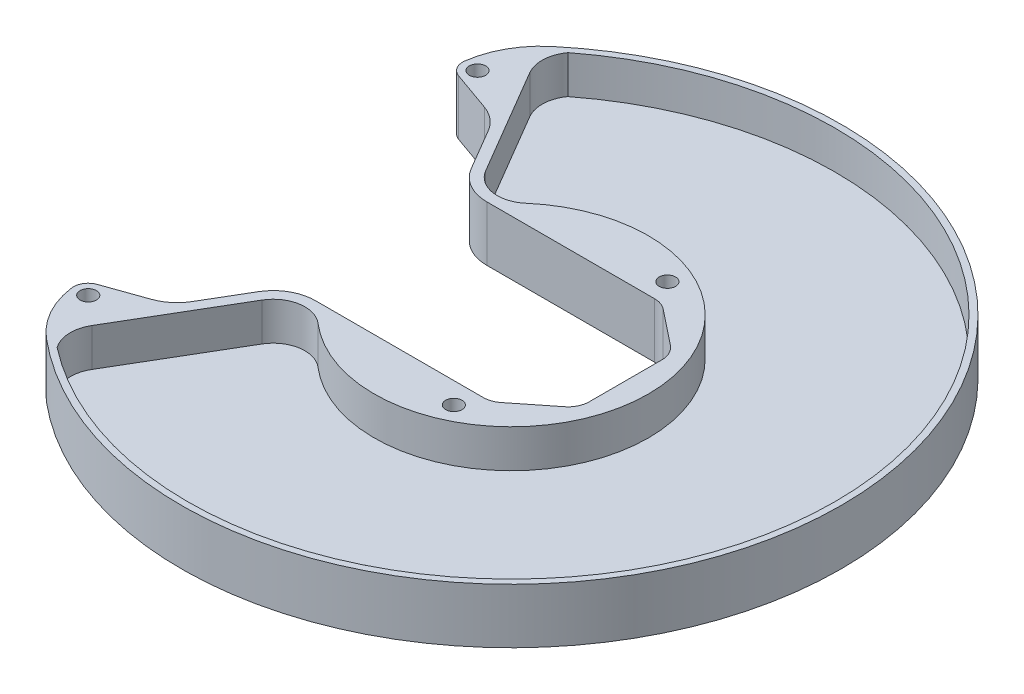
ISO-10303-21;
HEADER;
FILE_DESCRIPTION(('STEP AP214'),'2;1');
FILE_NAME('part.step','',(''),(''),'','','');
FILE_SCHEMA(('AUTOMOTIVE_DESIGN { 1 0 10303 214 1 1 1 1 }'));
ENDSEC;
DATA;
#1=APPLICATION_CONTEXT('core data for automotive mechanical design processes');
#2=APPLICATION_PROTOCOL_DEFINITION('international standard','automotive_design',2000,#1);
#3=PRODUCT_CONTEXT('',#1,'mechanical');
#4=PRODUCT('Part','Part','',(#3));
#5=PRODUCT_RELATED_PRODUCT_CATEGORY('part','',(#4));
#6=PRODUCT_DEFINITION_FORMATION('','',#4);
#7=PRODUCT_DEFINITION_CONTEXT('part definition',#1,'design');
#8=PRODUCT_DEFINITION('design','',#6,#7);
#9=PRODUCT_DEFINITION_SHAPE('','',#8);
#10=(LENGTH_UNIT() NAMED_UNIT(*) SI_UNIT(.MILLI.,.METRE.));
#11=(NAMED_UNIT(*) PLANE_ANGLE_UNIT() SI_UNIT($,.RADIAN.));
#12=(NAMED_UNIT(*) SI_UNIT($,.STERADIAN.) SOLID_ANGLE_UNIT());
#13=UNCERTAINTY_MEASURE_WITH_UNIT(LENGTH_MEASURE(1.E-05),#10,'distance_accuracy_value','');
#14=(GEOMETRIC_REPRESENTATION_CONTEXT(3) GLOBAL_UNCERTAINTY_ASSIGNED_CONTEXT((#13)) GLOBAL_UNIT_ASSIGNED_CONTEXT((#10,
#11,#12)) REPRESENTATION_CONTEXT('',''));
#15=CARTESIAN_POINT('',(0.,0.,0.));
#16=DIRECTION('',(0.,0.,1.));
#17=DIRECTION('',(1.,0.,0.));
#18=AXIS2_PLACEMENT_3D('',#15,#16,#17);
#19=CARTESIAN_POINT('',(-51.559580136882,16.51,-70.8038124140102));
#20=DIRECTION('',(0.,-1.,0.));
#21=DIRECTION('',(0.,0.,-1.));
#22=AXIS2_PLACEMENT_3D('',#19,#20,#21);
#23=CYLINDRICAL_SURFACE('',#22,10.0119999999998);
#24=DIRECTION('',(0.,-1.,0.));
#25=VECTOR('',#24,1.);
#26=CARTESIAN_POINT('',(-60.190030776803,16.51,-65.728828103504));
#27=LINE('',#26,#25);
#28=CARTESIAN_POINT('',(-60.190030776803,16.51,-65.728828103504));
#29=VERTEX_POINT('',#28);
#30=CARTESIAN_POINT('',(-60.190030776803,5.08,-65.728828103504));
#31=VERTEX_POINT('',#30);
#32=EDGE_CURVE('E343',#29,#31,#27,.T.);
#33=ORIENTED_EDGE('',*,*,#32,.T.);
#34=CARTESIAN_POINT('',(-51.559580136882,5.08,-70.8038124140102));
#35=DIRECTION('',(0.,-1.,0.));
#36=DIRECTION('',(0.,0.,-1.));
#37=AXIS2_PLACEMENT_3D('',#34,#35,#36);
#38=CIRCLE('',#37,10.0119999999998);
#39=CARTESIAN_POINT('',(-59.6737233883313,5.08,-76.6690339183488));
#40=VERTEX_POINT('',#39);
#41=EDGE_CURVE('E525',#31,#40,#38,.T.);
#42=ORIENTED_EDGE('',*,*,#41,.T.);
#43=DIRECTION('',(0.,-1.,0.));
#44=VECTOR('',#43,1.);
#45=CARTESIAN_POINT('',(-59.6737233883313,16.51,-76.6690339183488));
#46=LINE('',#45,#44);
#47=CARTESIAN_POINT('',(-59.6737233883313,16.51,-76.6690339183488));
#48=VERTEX_POINT('',#47);
#49=EDGE_CURVE('E499',#48,#40,#46,.T.);
#50=ORIENTED_EDGE('',*,*,#49,.F.);
#51=CARTESIAN_POINT('',(-51.559580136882,16.51,-70.8038124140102));
#52=DIRECTION('',(0.,1.,0.));
#53=DIRECTION('',(0.,0.,1.));
#54=AXIS2_PLACEMENT_3D('',#51,#52,#53);
#55=CIRCLE('',#54,10.0119999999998);
#56=EDGE_CURVE('E522',#48,#29,#55,.T.);
#57=ORIENTED_EDGE('',*,*,#56,.T.);
#58=EDGE_LOOP('',(#33,#42,#50,#57));
#59=FACE_BOUND('',#58,.T.);
#60=ADVANCED_FACE('F41',(#59),#23,.F.);
#61=CARTESIAN_POINT('',(-60.190030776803,16.51,-65.728828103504));
#62=DIRECTION('',(0.862010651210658,0.,-0.506890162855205));
#63=DIRECTION('',(-0.506890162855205,0.,-0.862010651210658));
#64=AXIS2_PLACEMENT_3D('',#61,#62,#63);
#65=PLANE('',#64);
#66=DIRECTION('',(0.,-1.,0.));
#67=VECTOR('',#66,1.);
#68=CARTESIAN_POINT('',(-41.2820936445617,16.51,-33.5742423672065));
#69=LINE('',#68,#67);
#70=CARTESIAN_POINT('',(-41.2820936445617,16.51,-33.5742423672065));
#71=VERTEX_POINT('',#70);
#72=CARTESIAN_POINT('',(-41.2820936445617,5.08,-33.5742423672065));
#73=VERTEX_POINT('',#72);
#74=EDGE_CURVE('E477',#71,#73,#69,.T.);
#75=ORIENTED_EDGE('',*,*,#74,.T.);
#76=DIRECTION('',(-0.506890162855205,0.,-0.862010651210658));
#77=VECTOR('',#76,1.);
#78=CARTESIAN_POINT('',(-60.190030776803,5.08,-65.728828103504));
#79=LINE('',#78,#77);
#80=EDGE_CURVE('E529',#73,#31,#79,.T.);
#81=ORIENTED_EDGE('',*,*,#80,.T.);
#82=ORIENTED_EDGE('',*,*,#32,.F.);
#83=DIRECTION('',(0.506890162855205,0.,0.862010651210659));
#84=VECTOR('',#83,1.);
#85=CARTESIAN_POINT('',(-60.190030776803,16.51,-65.728828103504));
#86=LINE('',#85,#84);
#87=EDGE_CURVE('E519',#29,#71,#86,.T.);
#88=ORIENTED_EDGE('',*,*,#87,.T.);
#89=EDGE_LOOP('',(#75,#81,#82,#88));
#90=FACE_BOUND('',#89,.T.);
#91=ADVANCED_FACE('F680',(#90),#65,.T.);
#92=CARTESIAN_POINT('',(-33.0714421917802,16.51,-38.4023711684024));
#93=DIRECTION('',(0.,-1.,0.));
#94=DIRECTION('',(0.,0.,-1.));
#95=AXIS2_PLACEMENT_3D('',#92,#93,#94);
#96=CYLINDRICAL_SURFACE('',#95,9.52500000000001);
#97=DIRECTION('',(0.,-1.,0.));
#98=VECTOR('',#97,1.);
#99=CARTESIAN_POINT('',(-26.8558643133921,16.51,-31.184877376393));
#100=LINE('',#99,#98);
#101=CARTESIAN_POINT('',(-26.8558643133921,16.51,-31.184877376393));
#102=VERTEX_POINT('',#101);
#103=CARTESIAN_POINT('',(-26.8558643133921,5.08,-31.184877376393));
#104=VERTEX_POINT('',#103);
#105=EDGE_CURVE('E481',#102,#104,#100,.T.);
#106=ORIENTED_EDGE('',*,*,#105,.T.);
#107=CARTESIAN_POINT('',(-33.0714421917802,5.08,-38.4023711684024));
#108=DIRECTION('',(0.,-1.,0.));
#109=DIRECTION('',(0.,0.,-1.));
#110=AXIS2_PLACEMENT_3D('',#107,#108,#109);
#111=CIRCLE('',#110,9.52500000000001);
#112=EDGE_CURVE('E533',#104,#73,#111,.T.);
#113=ORIENTED_EDGE('',*,*,#112,.T.);
#114=ORIENTED_EDGE('',*,*,#74,.F.);
#115=CARTESIAN_POINT('',(-33.0714421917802,16.51,-38.4023711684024));
#116=DIRECTION('',(0.,1.,0.));
#117=DIRECTION('',(0.,0.,-1.));
#118=AXIS2_PLACEMENT_3D('',#115,#116,#117);
#119=CIRCLE('',#118,9.52500000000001);
#120=EDGE_CURVE('E516',#71,#102,#119,.T.);
#121=ORIENTED_EDGE('',*,*,#120,.T.);
#122=EDGE_LOOP('',(#106,#113,#114,#121));
#123=FACE_BOUND('',#122,.T.);
#124=ADVANCED_FACE('F686',(#123),#96,.F.);
#125=CARTESIAN_POINT('',(0.,16.51,0.));
#126=DIRECTION('',(0.,-1.,0.));
#127=DIRECTION('',(0.,0.,-1.));
#128=AXIS2_PLACEMENT_3D('',#125,#126,#127);
#129=CYLINDRICAL_SURFACE('',#128,41.155);
#130=DIRECTION('',(0.,-1.,0.));
#131=VECTOR('',#130,1.);
#132=CARTESIAN_POINT('',(-26.8558643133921,16.51,31.184877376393));
#133=LINE('',#132,#131);
#134=CARTESIAN_POINT('',(-26.8558643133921,16.51,31.184877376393));
#135=VERTEX_POINT('',#134);
#136=CARTESIAN_POINT('',(-26.8558643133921,5.08,31.184877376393));
#137=VERTEX_POINT('',#136);
#138=EDGE_CURVE('E485',#135,#137,#133,.T.);
#139=ORIENTED_EDGE('',*,*,#138,.T.);
#140=CARTESIAN_POINT('',(0.,5.08,0.));
#141=DIRECTION('',(0.,-1.,0.));
#142=DIRECTION('',(0.,0.,-1.));
#143=AXIS2_PLACEMENT_3D('',#140,#141,#142);
#144=CIRCLE('',#143,41.155);
#145=EDGE_CURVE('E537',#137,#104,#144,.F.);
#146=ORIENTED_EDGE('',*,*,#145,.T.);
#147=ORIENTED_EDGE('',*,*,#105,.F.);
#148=CARTESIAN_POINT('',(0.,16.51,0.));
#149=DIRECTION('',(0.,-1.,0.));
#150=DIRECTION('',(0.,0.,-1.));
#151=AXIS2_PLACEMENT_3D('',#148,#149,#150);
#152=CIRCLE('',#151,41.155);
#153=EDGE_CURVE('E514',#102,#135,#152,.T.);
#154=ORIENTED_EDGE('',*,*,#153,.T.);
#155=EDGE_LOOP('',(#139,#146,#147,#154));
#156=FACE_BOUND('',#155,.T.);
#157=ADVANCED_FACE('F774',(#156),#129,.T.);
#158=CARTESIAN_POINT('',(-33.0714421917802,16.51,38.4023711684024));
#159=DIRECTION('',(0.,-1.,0.));
#160=DIRECTION('',(0.,0.,-1.));
#161=AXIS2_PLACEMENT_3D('',#158,#159,#160);
#162=CYLINDRICAL_SURFACE('',#161,9.52500000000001);
#163=DIRECTION('',(0.,-1.,0.));
#164=VECTOR('',#163,1.);
#165=CARTESIAN_POINT('',(-41.2820936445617,16.51,33.5742423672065));
#166=LINE('',#165,#164);
#167=CARTESIAN_POINT('',(-41.2820936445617,16.51,33.5742423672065));
#168=VERTEX_POINT('',#167);
#169=CARTESIAN_POINT('',(-41.2820936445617,5.08,33.5742423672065));
#170=VERTEX_POINT('',#169);
#171=EDGE_CURVE('E489',#168,#170,#166,.T.);
#172=ORIENTED_EDGE('',*,*,#171,.T.);
#173=CARTESIAN_POINT('',(-33.0714421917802,5.08,38.4023711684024));
#174=DIRECTION('',(0.,-1.,0.));
#175=DIRECTION('',(0.,0.,-1.));
#176=AXIS2_PLACEMENT_3D('',#173,#174,#175);
#177=CIRCLE('',#176,9.52500000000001);
#178=EDGE_CURVE('E541',#170,#137,#177,.T.);
#179=ORIENTED_EDGE('',*,*,#178,.T.);
#180=ORIENTED_EDGE('',*,*,#138,.F.);
#181=CARTESIAN_POINT('',(-33.0714421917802,16.51,38.4023711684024));
#182=DIRECTION('',(0.,1.,0.));
#183=DIRECTION('',(0.,0.,-1.));
#184=AXIS2_PLACEMENT_3D('',#181,#182,#183);
#185=CIRCLE('',#184,9.52500000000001);
#186=EDGE_CURVE('E512',#135,#168,#185,.T.);
#187=ORIENTED_EDGE('',*,*,#186,.T.);
#188=EDGE_LOOP('',(#172,#179,#180,#187));
#189=FACE_BOUND('',#188,.T.);
#190=ADVANCED_FACE('F770',(#189),#162,.F.);
#191=CARTESIAN_POINT('',(-60.190030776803,16.51,65.728828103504));
#192=DIRECTION('',(0.862010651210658,0.,0.506890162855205));
#193=DIRECTION('',(0.506890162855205,0.,-0.862010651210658));
#194=AXIS2_PLACEMENT_3D('',#191,#192,#193);
#195=PLANE('',#194);
#196=DIRECTION('',(0.,-1.,0.));
#197=VECTOR('',#196,1.);
#198=CARTESIAN_POINT('',(-60.190030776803,16.51,65.728828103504));
#199=LINE('',#198,#197);
#200=CARTESIAN_POINT('',(-60.190030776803,16.51,65.728828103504));
#201=VERTEX_POINT('',#200);
#202=CARTESIAN_POINT('',(-60.190030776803,5.08,65.728828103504));
#203=VERTEX_POINT('',#202);
#204=EDGE_CURVE('E493',#201,#203,#199,.T.);
#205=ORIENTED_EDGE('',*,*,#204,.T.);
#206=DIRECTION('',(0.506890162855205,0.,-0.862010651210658));
#207=VECTOR('',#206,1.);
#208=CARTESIAN_POINT('',(-60.190030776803,5.08,65.728828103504));
#209=LINE('',#208,#207);
#210=EDGE_CURVE('E544',#203,#170,#209,.T.);
#211=ORIENTED_EDGE('',*,*,#210,.T.);
#212=ORIENTED_EDGE('',*,*,#171,.F.);
#213=DIRECTION('',(-0.506890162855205,0.,0.862010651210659));
#214=VECTOR('',#213,1.);
#215=CARTESIAN_POINT('',(-60.190030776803,16.51,65.728828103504));
#216=LINE('',#215,#214);
#217=EDGE_CURVE('E509',#168,#201,#216,.T.);
#218=ORIENTED_EDGE('',*,*,#217,.T.);
#219=EDGE_LOOP('',(#205,#211,#212,#218));
#220=FACE_BOUND('',#219,.T.);
#221=ADVANCED_FACE('F766',(#220),#195,.T.);
#222=CARTESIAN_POINT('',(-51.559580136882,16.51,70.8038124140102));
#223=DIRECTION('',(0.,-1.,0.));
#224=DIRECTION('',(0.,0.,-1.));
#225=AXIS2_PLACEMENT_3D('',#222,#223,#224);
#226=CYLINDRICAL_SURFACE('',#225,10.0119999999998);
#227=DIRECTION('',(0.,-1.,0.));
#228=VECTOR('',#227,1.);
#229=CARTESIAN_POINT('',(-59.6737233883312,16.51,76.6690339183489));
#230=LINE('',#229,#228);
#231=CARTESIAN_POINT('',(-59.6737233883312,16.51,76.6690339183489));
#232=VERTEX_POINT('',#231);
#233=CARTESIAN_POINT('',(-59.6737233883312,5.08,76.6690339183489));
#234=VERTEX_POINT('',#233);
#235=EDGE_CURVE('E496',#232,#234,#230,.T.);
#236=ORIENTED_EDGE('',*,*,#235,.T.);
#237=CARTESIAN_POINT('',(-51.559580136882,5.08,70.8038124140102));
#238=DIRECTION('',(0.,-1.,0.));
#239=DIRECTION('',(0.,0.,-1.));
#240=AXIS2_PLACEMENT_3D('',#237,#238,#239);
#241=CIRCLE('',#240,10.0119999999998);
#242=EDGE_CURVE('E548',#234,#203,#241,.T.);
#243=ORIENTED_EDGE('',*,*,#242,.T.);
#244=ORIENTED_EDGE('',*,*,#204,.F.);
#245=CARTESIAN_POINT('',(-51.559580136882,16.51,70.8038124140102));
#246=DIRECTION('',(0.,1.,0.));
#247=DIRECTION('',(0.,0.,-1.));
#248=AXIS2_PLACEMENT_3D('',#245,#246,#247);
#249=CIRCLE('',#248,10.0119999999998);
#250=EDGE_CURVE('E506',#201,#232,#249,.T.);
#251=ORIENTED_EDGE('',*,*,#250,.T.);
#252=EDGE_LOOP('',(#236,#243,#244,#251));
#253=FACE_BOUND('',#252,.T.);
#254=ADVANCED_FACE('F762',(#253),#226,.F.);
#255=CARTESIAN_POINT('',(0.,16.51,0.));
#256=DIRECTION('',(0.,-1.,0.));
#257=DIRECTION('',(0.,0.,-1.));
#258=AXIS2_PLACEMENT_3D('',#255,#256,#257);
#259=CYLINDRICAL_SURFACE('',#258,97.155);
#260=ORIENTED_EDGE('',*,*,#49,.T.);
#261=CARTESIAN_POINT('',(0.,5.08,0.));
#262=DIRECTION('',(0.,-1.,0.));
#263=DIRECTION('',(0.,0.,-1.));
#264=AXIS2_PLACEMENT_3D('',#261,#262,#263);
#265=CIRCLE('',#264,97.155);
#266=EDGE_CURVE('E385',#40,#234,#265,.T.);
#267=ORIENTED_EDGE('',*,*,#266,.T.);
#268=ORIENTED_EDGE('',*,*,#235,.F.);
#269=CARTESIAN_POINT('',(0.,16.51,0.));
#270=DIRECTION('',(0.,1.,0.));
#271=DIRECTION('',(0.,0.,-1.));
#272=AXIS2_PLACEMENT_3D('',#269,#270,#271);
#273=CIRCLE('',#272,97.155);
#274=EDGE_CURVE('E503',#232,#48,#273,.T.);
#275=ORIENTED_EDGE('',*,*,#274,.T.);
#276=EDGE_LOOP('',(#260,#267,#268,#275));
#277=FACE_BOUND('',#276,.T.);
#278=ADVANCED_FACE('F654',(#277),#259,.F.);
#279=CARTESIAN_POINT('',(-33.0714421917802,16.51,-38.4023711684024));
#280=DIRECTION('',(0.,1.,0.));
#281=DIRECTION('',(0.,0.,1.));
#282=AXIS2_PLACEMENT_3D('',#279,#280,#281);
#283=PLANE('',#282);
#284=CARTESIAN_POINT('',(-68.58,16.51,-58.42));
#285=DIRECTION('',(0.,1.,0.));
#286=DIRECTION('',(0.,0.,1.));
#287=AXIS2_PLACEMENT_3D('',#284,#285,#286);
#288=CIRCLE('',#287,2.45745);
#289=CARTESIAN_POINT('',(-68.58,16.51,-55.96255));
#290=VERTEX_POINT('',#289);
#291=EDGE_CURVE('E645',#290,#290,#288,.T.);
#292=ORIENTED_EDGE('',*,*,#291,.F.);
#293=EDGE_LOOP('',(#292));
#294=FACE_BOUND('',#293,.T.);
#295=CARTESIAN_POINT('',(-68.58,16.51,58.42));
#296=DIRECTION('',(0.,1.,0.));
#297=DIRECTION('',(0.,0.,1.));
#298=AXIS2_PLACEMENT_3D('',#295,#296,#297);
#299=CIRCLE('',#298,2.45745);
#300=CARTESIAN_POINT('',(-68.58,16.51,60.87745));
#301=VERTEX_POINT('',#300);
#302=EDGE_CURVE('E637',#301,#301,#299,.T.);
#303=ORIENTED_EDGE('',*,*,#302,.F.);
#304=EDGE_LOOP('',(#303));
#305=FACE_BOUND('',#304,.T.);
#306=CARTESIAN_POINT('',(14.7983753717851,16.51,32.0523711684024));
#307=DIRECTION('',(0.,1.,0.));
#308=DIRECTION('',(0.,0.,1.));
#309=AXIS2_PLACEMENT_3D('',#306,#307,#308);
#310=CIRCLE('',#309,2.45745);
#311=CARTESIAN_POINT('',(14.7983753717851,16.51,34.5098211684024));
#312=VERTEX_POINT('',#311);
#313=EDGE_CURVE('E630',#312,#312,#310,.T.);
#314=ORIENTED_EDGE('',*,*,#313,.F.);
#315=EDGE_LOOP('',(#314));
#316=FACE_BOUND('',#315,.T.);
#317=CARTESIAN_POINT('',(14.7983753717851,16.51,-32.0523711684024));
#318=DIRECTION('',(0.,1.,0.));
#319=DIRECTION('',(0.,0.,1.));
#320=AXIS2_PLACEMENT_3D('',#317,#318,#319);
#321=CIRCLE('',#320,2.45745);
#322=CARTESIAN_POINT('',(14.7983753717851,16.51,-29.5949211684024));
#323=VERTEX_POINT('',#322);
#324=EDGE_CURVE('E623',#323,#323,#321,.T.);
#325=ORIENTED_EDGE('',*,*,#324,.F.);
#326=EDGE_LOOP('',(#325));
#327=FACE_BOUND('',#326,.T.);
#328=CARTESIAN_POINT('',(-62.3081755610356,16.51,-38.0124949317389));
#329=DIRECTION('',(0.,-1.,0.));
#330=DIRECTION('',(0.,0.,-1.));
#331=AXIS2_PLACEMENT_3D('',#328,#329,#330);
#332=CIRCLE('',#331,12.7);
#333=CARTESIAN_POINT('',(-58.0703499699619,16.51,-49.9845805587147));
#334=VERTEX_POINT('',#333);
#335=CARTESIAN_POINT('',(-51.3606402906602,16.51,-44.45));
#336=VERTEX_POINT('',#335);
#337=EDGE_CURVE('E560',#334,#336,#332,.T.);
#338=ORIENTED_EDGE('',*,*,#337,.T.);
#339=DIRECTION('',(0.506890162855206,0.,0.862010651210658));
#340=VECTOR('',#339,1.);
#341=CARTESIAN_POINT('',(-67.730120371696,16.51,-72.2877195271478));
#342=LINE('',#341,#340);
#343=CARTESIAN_POINT('',(-44.0189774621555,16.51,-31.9648661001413));
#344=VERTEX_POINT('',#343);
#345=EDGE_CURVE('E315',#336,#344,#342,.T.);
#346=ORIENTED_EDGE('',*,*,#345,.T.);
#347=CARTESIAN_POINT('',(-33.0714421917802,16.51,-38.4023711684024));
#348=DIRECTION('',(0.,1.,0.));
#349=DIRECTION('',(0.,0.,1.));
#350=AXIS2_PLACEMENT_3D('',#347,#348,#349);
#351=CIRCLE('',#350,12.7);
#352=CARTESIAN_POINT('',(-33.0714421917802,16.51,-25.7023711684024));
#353=VERTEX_POINT('',#352);
#354=EDGE_CURVE('E324',#344,#353,#351,.T.);
#355=ORIENTED_EDGE('',*,*,#354,.T.);
#356=DIRECTION('',(1.,0.,0.));
#357=VECTOR('',#356,1.);
#358=CARTESIAN_POINT('',(19.5169095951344,16.51,-25.7023711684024));
#359=LINE('',#358,#357);
#360=CARTESIAN_POINT('',(17.302149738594,16.51,-25.7023711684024));
#361=VERTEX_POINT('',#360);
#362=EDGE_CURVE('E327',#353,#361,#359,.T.);
#363=ORIENTED_EDGE('',*,*,#362,.T.);
#364=CARTESIAN_POINT('',(17.302149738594,16.51,-19.3523711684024));
#365=DIRECTION('',(0.,1.,0.));
#366=DIRECTION('',(0.,0.,1.));
#367=AXIS2_PLACEMENT_3D('',#364,#365,#366);
#368=CIRCLE('',#367,6.35);
#369=CARTESIAN_POINT('',(21.2512663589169,16.51,-24.324994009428));
#370=VERTEX_POINT('',#369);
#371=EDGE_CURVE('E428',#361,#370,#368,.F.);
#372=ORIENTED_EDGE('',*,*,#371,.T.);
#373=DIRECTION('',(0.783090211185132,0.,0.62190812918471));
#374=VECTOR('',#373,1.);
#375=CARTESIAN_POINT('',(19.5169095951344,16.51,-25.7023711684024));
#376=LINE('',#375,#374);
#377=CARTESIAN_POINT('',(31.8891166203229,16.51,-15.8767137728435));
#378=VERTEX_POINT('',#377);
#379=EDGE_CURVE('E331',#370,#378,#376,.T.);
#380=ORIENTED_EDGE('',*,*,#379,.T.);
#381=CARTESIAN_POINT('',(27.94,16.51,-10.904090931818));
#382=DIRECTION('',(0.,1.,0.));
#383=DIRECTION('',(0.,0.,1.));
#384=AXIS2_PLACEMENT_3D('',#381,#382,#383);
#385=CIRCLE('',#384,6.35);
#386=CARTESIAN_POINT('',(34.29,16.51,-10.904090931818));
#387=VERTEX_POINT('',#386);
#388=EDGE_CURVE('E11',#378,#387,#385,.F.);
#389=ORIENTED_EDGE('',*,*,#388,.T.);
#390=DIRECTION('',(0.,0.,1.));
#391=VECTOR('',#390,1.);
#392=CARTESIAN_POINT('',(34.29,16.51,13.97));
#393=LINE('',#392,#391);
#394=CARTESIAN_POINT('',(34.29,16.51,10.904090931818));
#395=VERTEX_POINT('',#394);
#396=EDGE_CURVE('E334',#387,#395,#393,.T.);
#397=ORIENTED_EDGE('',*,*,#396,.T.);
#398=CARTESIAN_POINT('',(27.94,16.51,10.904090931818));
#399=DIRECTION('',(0.,1.,0.));
#400=DIRECTION('',(0.,0.,1.));
#401=AXIS2_PLACEMENT_3D('',#398,#399,#400);
#402=CIRCLE('',#401,6.35);
#403=CARTESIAN_POINT('',(31.8891166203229,16.51,15.8767137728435));
#404=VERTEX_POINT('',#403);
#405=EDGE_CURVE('E434',#395,#404,#402,.F.);
#406=ORIENTED_EDGE('',*,*,#405,.T.);
#407=DIRECTION('',(-0.783090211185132,0.,0.62190812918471));
#408=VECTOR('',#407,1.);
#409=CARTESIAN_POINT('',(19.5169095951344,16.51,25.7023711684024));
#410=LINE('',#409,#408);
#411=CARTESIAN_POINT('',(21.2512663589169,16.51,24.324994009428));
#412=VERTEX_POINT('',#411);
#413=EDGE_CURVE('E372',#404,#412,#410,.T.);
#414=ORIENTED_EDGE('',*,*,#413,.T.);
#415=CARTESIAN_POINT('',(17.302149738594,16.51,19.3523711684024));
#416=DIRECTION('',(0.,1.,0.));
#417=DIRECTION('',(0.,0.,1.));
#418=AXIS2_PLACEMENT_3D('',#415,#416,#417);
#419=CIRCLE('',#418,6.35);
#420=CARTESIAN_POINT('',(17.302149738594,16.51,25.7023711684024));
#421=VERTEX_POINT('',#420);
#422=EDGE_CURVE('E423',#412,#421,#419,.F.);
#423=ORIENTED_EDGE('',*,*,#422,.T.);
#424=DIRECTION('',(-1.,0.,0.));
#425=VECTOR('',#424,1.);
#426=CARTESIAN_POINT('',(19.5169095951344,16.51,25.7023711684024));
#427=LINE('',#426,#425);
#428=CARTESIAN_POINT('',(-33.0714421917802,16.51,25.7023711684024));
#429=VERTEX_POINT('',#428);
#430=EDGE_CURVE('E318',#421,#429,#427,.T.);
#431=ORIENTED_EDGE('',*,*,#430,.T.);
#432=CARTESIAN_POINT('',(-33.0714421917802,16.51,38.4023711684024));
#433=DIRECTION('',(0.,1.,0.));
#434=DIRECTION('',(0.,0.,-1.));
#435=AXIS2_PLACEMENT_3D('',#432,#433,#434);
#436=CIRCLE('',#435,12.7);
#437=CARTESIAN_POINT('',(-44.0189774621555,16.51,31.9648661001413));
#438=VERTEX_POINT('',#437);
#439=EDGE_CURVE('E306',#429,#438,#436,.T.);
#440=ORIENTED_EDGE('',*,*,#439,.T.);
#441=DIRECTION('',(-0.506890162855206,0.,0.862010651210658));
#442=VECTOR('',#441,1.);
#443=CARTESIAN_POINT('',(-67.730120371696,16.51,72.2877195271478));
#444=LINE('',#443,#442);
#445=CARTESIAN_POINT('',(-51.3606402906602,16.51,44.45));
#446=VERTEX_POINT('',#445);
#447=EDGE_CURVE('E297',#438,#446,#444,.T.);
#448=ORIENTED_EDGE('',*,*,#447,.T.);
#449=CARTESIAN_POINT('',(-62.3081755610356,16.51,38.0124949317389));
#450=DIRECTION('',(0.,1.,0.));
#451=DIRECTION('',(0.,0.,1.));
#452=AXIS2_PLACEMENT_3D('',#449,#450,#451);
#453=CIRCLE('',#452,12.7);
#454=CARTESIAN_POINT('',(-58.0703499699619,16.51,49.9845805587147));
#455=VERTEX_POINT('',#454);
#456=EDGE_CURVE('E279',#455,#446,#453,.T.);
#457=ORIENTED_EDGE('',*,*,#456,.F.);
#458=DIRECTION('',(0.94268390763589,0.,-0.333687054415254));
#459=VECTOR('',#458,1.);
#460=CARTESIAN_POINT('',(-70.0632389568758,16.51,54.2297700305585));
#461=LINE('',#460,#459);
#462=CARTESIAN_POINT('',(-70.0632389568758,16.51,54.2297700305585));
#463=VERTEX_POINT('',#462);
#464=EDGE_CURVE('E291',#463,#455,#461,.T.);
#465=ORIENTED_EDGE('',*,*,#464,.F.);
#466=CARTESIAN_POINT('',(-68.58,16.51,58.42));
#467=DIRECTION('',(0.,-1.,0.));
#468=DIRECTION('',(0.,0.,-1.));
#469=AXIS2_PLACEMENT_3D('',#466,#467,#468);
#470=CIRCLE('',#469,4.445);
#471=CARTESIAN_POINT('',(-72.9842416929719,16.51,59.0205664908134));
#472=VERTEX_POINT('',#471);
#473=EDGE_CURVE('E602',#472,#463,#470,.T.);
#474=ORIENTED_EDGE('',*,*,#473,.F.);
#475=CARTESIAN_POINT('',(-46.5184478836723,16.51,55.4116662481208));
#476=DIRECTION('',(0.,-1.,0.));
#477=DIRECTION('',(0.,0.,1.));
#478=AXIS2_PLACEMENT_3D('',#475,#476,#477);
#479=CIRCLE('',#478,26.7107170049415);
#480=CARTESIAN_POINT('',(-63.6926484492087,16.51,75.8691645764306));
#481=VERTEX_POINT('',#480);
#482=EDGE_CURVE('E300',#481,#472,#479,.T.);
#483=ORIENTED_EDGE('',*,*,#482,.F.);
#484=CARTESIAN_POINT('',(0.,16.51,0.));
#485=DIRECTION('',(0.,1.,0.));
#486=DIRECTION('',(0.,0.,1.));
#487=AXIS2_PLACEMENT_3D('',#484,#485,#486);
#488=CIRCLE('',#487,99.06);
#489=CARTESIAN_POINT('',(-63.6926484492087,16.51,-75.8691645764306));
#490=VERTEX_POINT('',#489);
#491=EDGE_CURVE('E309',#481,#490,#488,.T.);
#492=ORIENTED_EDGE('',*,*,#491,.T.);
#493=CARTESIAN_POINT('',(-46.5184478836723,16.51,-55.4116662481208));
#494=DIRECTION('',(0.,1.,0.));
#495=DIRECTION('',(0.,0.,-1.));
#496=AXIS2_PLACEMENT_3D('',#493,#494,#495);
#497=CIRCLE('',#496,26.7107170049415);
#498=CARTESIAN_POINT('',(-72.9842416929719,16.51,-59.0205664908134));
#499=VERTEX_POINT('',#498);
#500=EDGE_CURVE('E579',#490,#499,#497,.T.);
#501=ORIENTED_EDGE('',*,*,#500,.T.);
#502=CARTESIAN_POINT('',(-68.58,16.51,-58.42));
#503=DIRECTION('',(0.,1.,0.));
#504=DIRECTION('',(0.,0.,1.));
#505=AXIS2_PLACEMENT_3D('',#502,#503,#504);
#506=CIRCLE('',#505,4.445);
#507=CARTESIAN_POINT('',(-70.0632389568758,16.51,-54.2297700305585));
#508=VERTEX_POINT('',#507);
#509=EDGE_CURVE('E575',#499,#508,#506,.T.);
#510=ORIENTED_EDGE('',*,*,#509,.T.);
#511=DIRECTION('',(0.94268390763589,0.,0.333687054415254));
#512=VECTOR('',#511,1.);
#513=CARTESIAN_POINT('',(-70.0632389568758,16.51,-54.2297700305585));
#514=LINE('',#513,#512);
#515=EDGE_CURVE('E571',#508,#334,#514,.T.);
#516=ORIENTED_EDGE('',*,*,#515,.T.);
#517=EDGE_LOOP('',(#338,#346,#355,#363,#372,#380,#389,#397,#406,#414,#423,#431,#440,#448,#457,
#465,#474,#483,#492,#501,#510,#516));
#518=FACE_BOUND('',#517,.T.);
#519=ORIENTED_EDGE('',*,*,#87,.F.);
#520=ORIENTED_EDGE('',*,*,#56,.F.);
#521=ORIENTED_EDGE('',*,*,#274,.F.);
#522=ORIENTED_EDGE('',*,*,#250,.F.);
#523=ORIENTED_EDGE('',*,*,#217,.F.);
#524=ORIENTED_EDGE('',*,*,#186,.F.);
#525=ORIENTED_EDGE('',*,*,#153,.F.);
#526=ORIENTED_EDGE('',*,*,#120,.F.);
#527=EDGE_LOOP('',(#519,#520,#521,#522,#523,#524,#525,#526));
#528=FACE_BOUND('',#527,.T.);
#529=ADVANCED_FACE('F303',(#294,#305,#316,#327,#518,#528),#283,.T.);
#530=CARTESIAN_POINT('',(-33.0714421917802,0.,-38.4023711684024));
#531=DIRECTION('',(0.,1.,0.));
#532=DIRECTION('',(0.,0.,1.));
#533=AXIS2_PLACEMENT_3D('',#530,#531,#532);
#534=PLANE('',#533);
#535=CARTESIAN_POINT('',(-68.58,0.,-58.42));
#536=DIRECTION('',(0.,1.,0.));
#537=DIRECTION('',(0.,0.,1.));
#538=AXIS2_PLACEMENT_3D('',#535,#536,#537);
#539=CIRCLE('',#538,2.45745);
#540=CARTESIAN_POINT('',(-68.58,0.,-55.96255));
#541=VERTEX_POINT('',#540);
#542=EDGE_CURVE('E641',#541,#541,#539,.T.);
#543=ORIENTED_EDGE('',*,*,#542,.T.);
#544=EDGE_LOOP('',(#543));
#545=FACE_BOUND('',#544,.T.);
#546=CARTESIAN_POINT('',(-68.58,0.,58.42));
#547=DIRECTION('',(0.,1.,0.));
#548=DIRECTION('',(0.,0.,1.));
#549=AXIS2_PLACEMENT_3D('',#546,#547,#548);
#550=CIRCLE('',#549,2.45745);
#551=CARTESIAN_POINT('',(-68.58,0.,60.87745));
#552=VERTEX_POINT('',#551);
#553=EDGE_CURVE('E633',#552,#552,#550,.T.);
#554=ORIENTED_EDGE('',*,*,#553,.T.);
#555=EDGE_LOOP('',(#554));
#556=FACE_BOUND('',#555,.T.);
#557=CARTESIAN_POINT('',(14.7983753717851,0.,32.0523711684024));
#558=DIRECTION('',(0.,1.,0.));
#559=DIRECTION('',(0.,0.,1.));
#560=AXIS2_PLACEMENT_3D('',#557,#558,#559);
#561=CIRCLE('',#560,2.45745);
#562=CARTESIAN_POINT('',(14.7983753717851,0.,34.5098211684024));
#563=VERTEX_POINT('',#562);
#564=EDGE_CURVE('E627',#563,#563,#561,.T.);
#565=ORIENTED_EDGE('',*,*,#564,.T.);
#566=EDGE_LOOP('',(#565));
#567=FACE_BOUND('',#566,.T.);
#568=CARTESIAN_POINT('',(14.7983753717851,0.,-32.0523711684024));
#569=DIRECTION('',(0.,1.,0.));
#570=DIRECTION('',(0.,0.,1.));
#571=AXIS2_PLACEMENT_3D('',#568,#569,#570);
#572=CIRCLE('',#571,2.45745);
#573=CARTESIAN_POINT('',(14.7983753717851,0.,-29.5949211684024));
#574=VERTEX_POINT('',#573);
#575=EDGE_CURVE('E292',#574,#574,#572,.T.);
#576=ORIENTED_EDGE('',*,*,#575,.T.);
#577=EDGE_LOOP('',(#576));
#578=FACE_BOUND('',#577,.T.);
#579=CARTESIAN_POINT('',(-62.3081755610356,0.,38.0124949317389));
#580=DIRECTION('',(0.,1.,0.));
#581=DIRECTION('',(0.,0.,1.));
#582=AXIS2_PLACEMENT_3D('',#579,#580,#581);
#583=CIRCLE('',#582,12.7);
#584=CARTESIAN_POINT('',(-51.3606402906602,0.,44.45));
#585=VERTEX_POINT('',#584);
#586=CARTESIAN_POINT('',(-58.0703499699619,0.,49.9845805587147));
#587=VERTEX_POINT('',#586);
#588=EDGE_CURVE('E598',#585,#587,#583,.F.);
#589=ORIENTED_EDGE('',*,*,#588,.F.);
#590=DIRECTION('',(-0.506890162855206,0.,0.862010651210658));
#591=VECTOR('',#590,1.);
#592=CARTESIAN_POINT('',(-67.730120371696,0.,72.2877195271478));
#593=LINE('',#592,#591);
#594=CARTESIAN_POINT('',(-44.0189774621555,0.,31.9648661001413));
#595=VERTEX_POINT('',#594);
#596=EDGE_CURVE('E299',#595,#585,#593,.T.);
#597=ORIENTED_EDGE('',*,*,#596,.F.);
#598=CARTESIAN_POINT('',(-33.0714421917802,0.,38.4023711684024));
#599=DIRECTION('',(0.,1.,0.));
#600=DIRECTION('',(0.,0.,-1.));
#601=AXIS2_PLACEMENT_3D('',#598,#599,#600);
#602=CIRCLE('',#601,12.7);
#603=CARTESIAN_POINT('',(-33.0714421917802,0.,25.7023711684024));
#604=VERTEX_POINT('',#603);
#605=EDGE_CURVE('E346',#604,#595,#602,.T.);
#606=ORIENTED_EDGE('',*,*,#605,.F.);
#607=DIRECTION('',(-1.,0.,0.));
#608=VECTOR('',#607,1.);
#609=CARTESIAN_POINT('',(19.5169095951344,0.,25.7023711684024));
#610=LINE('',#609,#608);
#611=CARTESIAN_POINT('',(17.302149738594,0.,25.7023711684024));
#612=VERTEX_POINT('',#611);
#613=EDGE_CURVE('E342',#612,#604,#610,.T.);
#614=ORIENTED_EDGE('',*,*,#613,.F.);
#615=CARTESIAN_POINT('',(17.302149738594,0.,19.3523711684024));
#616=DIRECTION('',(0.,1.,0.));
#617=DIRECTION('',(0.,0.,1.));
#618=AXIS2_PLACEMENT_3D('',#615,#616,#617);
#619=CIRCLE('',#618,6.35);
#620=CARTESIAN_POINT('',(21.2512663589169,0.,24.324994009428));
#621=VERTEX_POINT('',#620);
#622=EDGE_CURVE('E421',#612,#621,#619,.T.);
#623=ORIENTED_EDGE('',*,*,#622,.T.);
#624=DIRECTION('',(-0.783090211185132,0.,0.62190812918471));
#625=VECTOR('',#624,1.);
#626=CARTESIAN_POINT('',(19.5169095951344,0.,25.7023711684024));
#627=LINE('',#626,#625);
#628=CARTESIAN_POINT('',(31.8891166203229,0.,15.8767137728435));
#629=VERTEX_POINT('',#628);
#630=EDGE_CURVE('E338',#629,#621,#627,.T.);
#631=ORIENTED_EDGE('',*,*,#630,.F.);
#632=CARTESIAN_POINT('',(27.94,0.,10.904090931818));
#633=DIRECTION('',(0.,1.,0.));
#634=DIRECTION('',(0.,0.,1.));
#635=AXIS2_PLACEMENT_3D('',#632,#633,#634);
#636=CIRCLE('',#635,6.35);
#637=CARTESIAN_POINT('',(34.29,0.,10.904090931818));
#638=VERTEX_POINT('',#637);
#639=EDGE_CURVE('E431',#629,#638,#636,.T.);
#640=ORIENTED_EDGE('',*,*,#639,.T.);
#641=DIRECTION('',(0.,0.,1.));
#642=VECTOR('',#641,1.);
#643=CARTESIAN_POINT('',(34.29,0.,13.97));
#644=LINE('',#643,#642);
#645=CARTESIAN_POINT('',(34.29,0.,-10.904090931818));
#646=VERTEX_POINT('',#645);
#647=EDGE_CURVE('E369',#646,#638,#644,.T.);
#648=ORIENTED_EDGE('',*,*,#647,.F.);
#649=CARTESIAN_POINT('',(27.94,0.,-10.904090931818));
#650=DIRECTION('',(0.,1.,0.));
#651=DIRECTION('',(0.,0.,1.));
#652=AXIS2_PLACEMENT_3D('',#649,#650,#651);
#653=CIRCLE('',#652,6.35);
#654=CARTESIAN_POINT('',(31.8891166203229,0.,-15.8767137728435));
#655=VERTEX_POINT('',#654);
#656=EDGE_CURVE('E50',#646,#655,#653,.T.);
#657=ORIENTED_EDGE('',*,*,#656,.T.);
#658=DIRECTION('',(0.783090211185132,0.,0.62190812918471));
#659=VECTOR('',#658,1.);
#660=CARTESIAN_POINT('',(19.5169095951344,0.,-25.7023711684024));
#661=LINE('',#660,#659);
#662=CARTESIAN_POINT('',(21.2512663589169,0.,-24.324994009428));
#663=VERTEX_POINT('',#662);
#664=EDGE_CURVE('E365',#663,#655,#661,.T.);
#665=ORIENTED_EDGE('',*,*,#664,.F.);
#666=CARTESIAN_POINT('',(17.302149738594,0.,-19.3523711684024));
#667=DIRECTION('',(0.,1.,0.));
#668=DIRECTION('',(0.,0.,1.));
#669=AXIS2_PLACEMENT_3D('',#666,#667,#668);
#670=CIRCLE('',#669,6.35);
#671=CARTESIAN_POINT('',(17.302149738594,0.,-25.7023711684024));
#672=VERTEX_POINT('',#671);
#673=EDGE_CURVE('E425',#663,#672,#670,.T.);
#674=ORIENTED_EDGE('',*,*,#673,.T.);
#675=DIRECTION('',(1.,0.,0.));
#676=VECTOR('',#675,1.);
#677=CARTESIAN_POINT('',(19.5169095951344,0.,-25.7023711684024));
#678=LINE('',#677,#676);
#679=CARTESIAN_POINT('',(-33.0714421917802,0.,-25.7023711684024));
#680=VERTEX_POINT('',#679);
#681=EDGE_CURVE('E361',#680,#672,#678,.T.);
#682=ORIENTED_EDGE('',*,*,#681,.F.);
#683=CARTESIAN_POINT('',(-33.0714421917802,0.,-38.4023711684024));
#684=DIRECTION('',(0.,1.,0.));
#685=DIRECTION('',(0.,0.,1.));
#686=AXIS2_PLACEMENT_3D('',#683,#684,#685);
#687=CIRCLE('',#686,12.7);
#688=CARTESIAN_POINT('',(-44.0189774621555,0.,-31.9648661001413));
#689=VERTEX_POINT('',#688);
#690=EDGE_CURVE('E358',#689,#680,#687,.T.);
#691=ORIENTED_EDGE('',*,*,#690,.F.);
#692=DIRECTION('',(0.506890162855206,0.,0.862010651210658));
#693=VECTOR('',#692,1.);
#694=CARTESIAN_POINT('',(-67.730120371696,0.,-72.2877195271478));
#695=LINE('',#694,#693);
#696=CARTESIAN_POINT('',(-51.3606402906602,0.,-44.45));
#697=VERTEX_POINT('',#696);
#698=EDGE_CURVE('E356',#697,#689,#695,.T.);
#699=ORIENTED_EDGE('',*,*,#698,.F.);
#700=CARTESIAN_POINT('',(-62.3081755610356,0.,-38.0124949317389));
#701=DIRECTION('',(0.,1.,0.));
#702=DIRECTION('',(0.,0.,1.));
#703=AXIS2_PLACEMENT_3D('',#700,#701,#702);
#704=CIRCLE('',#703,12.7);
#705=CARTESIAN_POINT('',(-58.0703499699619,0.,-49.9845805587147));
#706=VERTEX_POINT('',#705);
#707=EDGE_CURVE('E555',#697,#706,#704,.T.);
#708=ORIENTED_EDGE('',*,*,#707,.T.);
#709=DIRECTION('',(-0.94268390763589,0.,-0.333687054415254));
#710=VECTOR('',#709,1.);
#711=CARTESIAN_POINT('',(-70.0632389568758,0.,-54.2297700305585));
#712=LINE('',#711,#710);
#713=CARTESIAN_POINT('',(-70.0632389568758,0.,-54.2297700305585));
#714=VERTEX_POINT('',#713);
#715=EDGE_CURVE('E586',#706,#714,#712,.T.);
#716=ORIENTED_EDGE('',*,*,#715,.T.);
#717=CARTESIAN_POINT('',(-68.58,0.,-58.42));
#718=DIRECTION('',(0.,1.,0.));
#719=DIRECTION('',(0.,0.,1.));
#720=AXIS2_PLACEMENT_3D('',#717,#718,#719);
#721=CIRCLE('',#720,4.445);
#722=CARTESIAN_POINT('',(-72.9842416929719,0.,-59.0205664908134));
#723=VERTEX_POINT('',#722);
#724=EDGE_CURVE('E568',#714,#723,#721,.F.);
#725=ORIENTED_EDGE('',*,*,#724,.T.);
#726=CARTESIAN_POINT('',(-46.5184478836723,0.,-55.4116662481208));
#727=DIRECTION('',(0.,1.,0.));
#728=DIRECTION('',(0.,0.,1.));
#729=AXIS2_PLACEMENT_3D('',#726,#727,#728);
#730=CIRCLE('',#729,26.7107170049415);
#731=CARTESIAN_POINT('',(-63.6926484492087,0.,-75.8691645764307));
#732=VERTEX_POINT('',#731);
#733=EDGE_CURVE('E551',#723,#732,#730,.F.);
#734=ORIENTED_EDGE('',*,*,#733,.T.);
#735=CARTESIAN_POINT('',(0.,0.,0.));
#736=DIRECTION('',(0.,1.,0.));
#737=DIRECTION('',(0.,0.,1.));
#738=AXIS2_PLACEMENT_3D('',#735,#736,#737);
#739=CIRCLE('',#738,99.06);
#740=CARTESIAN_POINT('',(-63.6926484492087,0.,75.8691645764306));
#741=VERTEX_POINT('',#740);
#742=EDGE_CURVE('E352',#741,#732,#739,.T.);
#743=ORIENTED_EDGE('',*,*,#742,.F.);
#744=CARTESIAN_POINT('',(-46.5184478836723,0.,55.4116662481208));
#745=DIRECTION('',(0.,1.,0.));
#746=DIRECTION('',(0.,0.,1.));
#747=AXIS2_PLACEMENT_3D('',#744,#745,#746);
#748=CIRCLE('',#747,26.7107170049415);
#749=CARTESIAN_POINT('',(-72.9842416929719,0.,59.0205664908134));
#750=VERTEX_POINT('',#749);
#751=EDGE_CURVE('E583',#750,#741,#748,.T.);
#752=ORIENTED_EDGE('',*,*,#751,.F.);
#753=CARTESIAN_POINT('',(-68.58,0.,58.42));
#754=DIRECTION('',(0.,1.,0.));
#755=DIRECTION('',(0.,0.,1.));
#756=AXIS2_PLACEMENT_3D('',#753,#754,#755);
#757=CIRCLE('',#756,4.445);
#758=CARTESIAN_POINT('',(-70.0632389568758,0.,54.2297700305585));
#759=VERTEX_POINT('',#758);
#760=EDGE_CURVE('E610',#759,#750,#757,.T.);
#761=ORIENTED_EDGE('',*,*,#760,.F.);
#762=DIRECTION('',(-0.94268390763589,0.,0.333687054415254));
#763=VECTOR('',#762,1.);
#764=CARTESIAN_POINT('',(-70.0632389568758,0.,54.2297700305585));
#765=LINE('',#764,#763);
#766=EDGE_CURVE('E614',#587,#759,#765,.T.);
#767=ORIENTED_EDGE('',*,*,#766,.F.);
#768=EDGE_LOOP('',(#589,#597,#606,#614,#623,#631,#640,#648,#657,#665,#674,#682,#691,#699,#708,
#716,#725,#734,#743,#752,#761,#767));
#769=FACE_BOUND('',#768,.T.);
#770=ADVANCED_FACE('F440',(#545,#556,#567,#578,#769),#534,.F.);
#771=CARTESIAN_POINT('',(19.5169095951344,16.51,25.7023711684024));
#772=DIRECTION('',(0.62190812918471,0.,0.783090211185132));
#773=DIRECTION('',(0.783090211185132,0.,-0.62190812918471));
#774=AXIS2_PLACEMENT_3D('',#771,#772,#773);
#775=PLANE('',#774);
#776=ORIENTED_EDGE('',*,*,#630,.T.);
#777=DIRECTION('',(0.,-1.,0.));
#778=VECTOR('',#777,1.);
#779=CARTESIAN_POINT('',(21.2512663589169,16.51,24.324994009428));
#780=LINE('',#779,#778);
#781=EDGE_CURVE('E396',#621,#412,#780,.F.);
#782=ORIENTED_EDGE('',*,*,#781,.T.);
#783=ORIENTED_EDGE('',*,*,#413,.F.);
#784=DIRECTION('',(0.,-1.,0.));
#785=VECTOR('',#784,1.);
#786=CARTESIAN_POINT('',(31.8891166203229,0.,15.8767137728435));
#787=LINE('',#786,#785);
#788=EDGE_CURVE('E392',#404,#629,#787,.T.);
#789=ORIENTED_EDGE('',*,*,#788,.T.);
#790=EDGE_LOOP('',(#776,#782,#783,#789));
#791=FACE_BOUND('',#790,.T.);
#792=ADVANCED_FACE('F457',(#791),#775,.F.);
#793=CARTESIAN_POINT('',(19.5169095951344,16.51,25.7023711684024));
#794=DIRECTION('',(0.,0.,1.));
#795=DIRECTION('',(1.,0.,0.));
#796=AXIS2_PLACEMENT_3D('',#793,#794,#795);
#797=PLANE('',#796);
#798=ORIENTED_EDGE('',*,*,#430,.F.);
#799=DIRECTION('',(0.,-1.,0.));
#800=VECTOR('',#799,1.);
#801=CARTESIAN_POINT('',(17.302149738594,0.,25.7023711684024));
#802=LINE('',#801,#800);
#803=EDGE_CURVE('E389',#421,#612,#802,.T.);
#804=ORIENTED_EDGE('',*,*,#803,.T.);
#805=ORIENTED_EDGE('',*,*,#613,.T.);
#806=DIRECTION('',(0.,-1.,0.));
#807=VECTOR('',#806,1.);
#808=CARTESIAN_POINT('',(-33.0714421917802,16.51,25.7023711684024));
#809=LINE('',#808,#807);
#810=EDGE_CURVE('E381',#429,#604,#809,.T.);
#811=ORIENTED_EDGE('',*,*,#810,.F.);
#812=EDGE_LOOP('',(#798,#804,#805,#811));
#813=FACE_BOUND('',#812,.T.);
#814=ADVANCED_FACE('F467',(#813),#797,.F.);
#815=CARTESIAN_POINT('',(-33.0714421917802,16.51,38.4023711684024));
#816=DIRECTION('',(0.,-1.,0.));
#817=DIRECTION('',(0.,0.,-1.));
#818=AXIS2_PLACEMENT_3D('',#815,#816,#817);
#819=CYLINDRICAL_SURFACE('',#818,12.7);
#820=ORIENTED_EDGE('',*,*,#605,.T.);
#821=DIRECTION('',(0.,-1.,0.));
#822=VECTOR('',#821,1.);
#823=CARTESIAN_POINT('',(-44.0189774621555,16.51,31.9648661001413));
#824=LINE('',#823,#822);
#825=EDGE_CURVE('E379',#438,#595,#824,.T.);
#826=ORIENTED_EDGE('',*,*,#825,.F.);
#827=ORIENTED_EDGE('',*,*,#439,.F.);
#828=ORIENTED_EDGE('',*,*,#810,.T.);
#829=EDGE_LOOP('',(#820,#826,#827,#828));
#830=FACE_BOUND('',#829,.T.);
#831=ADVANCED_FACE('F717',(#830),#819,.T.);
#832=CARTESIAN_POINT('',(-67.730120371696,16.51,72.2877195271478));
#833=DIRECTION('',(0.862010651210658,0.,0.506890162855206));
#834=DIRECTION('',(0.506890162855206,0.,-0.862010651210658));
#835=AXIS2_PLACEMENT_3D('',#832,#833,#834);
#836=PLANE('',#835);
#837=ORIENTED_EDGE('',*,*,#596,.T.);
#838=DIRECTION('',(0.,1.,0.));
#839=VECTOR('',#838,1.);
#840=CARTESIAN_POINT('',(-51.3606402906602,-38.1642291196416,44.45));
#841=LINE('',#840,#839);
#842=EDGE_CURVE('E283',#585,#446,#841,.T.);
#843=ORIENTED_EDGE('',*,*,#842,.T.);
#844=ORIENTED_EDGE('',*,*,#447,.F.);
#845=ORIENTED_EDGE('',*,*,#825,.T.);
#846=EDGE_LOOP('',(#837,#843,#844,#845));
#847=FACE_BOUND('',#846,.T.);
#848=ADVANCED_FACE('F296',(#847),#836,.F.);
#849=CARTESIAN_POINT('',(0.,16.51,0.));
#850=DIRECTION('',(0.,-1.,0.));
#851=DIRECTION('',(0.,0.,-1.));
#852=AXIS2_PLACEMENT_3D('',#849,#850,#851);
#853=CYLINDRICAL_SURFACE('',#852,99.06);
#854=ORIENTED_EDGE('',*,*,#491,.F.);
#855=DIRECTION('',(0.,-1.,0.));
#856=VECTOR('',#855,1.);
#857=CARTESIAN_POINT('',(-63.6926484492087,16.51,75.8691645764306));
#858=LINE('',#857,#856);
#859=EDGE_CURVE('E412',#481,#741,#858,.T.);
#860=ORIENTED_EDGE('',*,*,#859,.T.);
#861=ORIENTED_EDGE('',*,*,#742,.T.);
#862=DIRECTION('',(0.,-1.,0.));
#863=VECTOR('',#862,1.);
#864=CARTESIAN_POINT('',(-63.6926484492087,16.51,-75.8691645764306));
#865=LINE('',#864,#863);
#866=EDGE_CURVE('E408',#732,#490,#865,.F.);
#867=ORIENTED_EDGE('',*,*,#866,.T.);
#868=EDGE_LOOP('',(#854,#860,#861,#867));
#869=FACE_BOUND('',#868,.T.);
#870=ADVANCED_FACE('F710',(#869),#853,.T.);
#871=CARTESIAN_POINT('',(-67.730120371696,16.51,-72.2877195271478));
#872=DIRECTION('',(0.862010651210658,0.,-0.506890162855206));
#873=DIRECTION('',(-0.506890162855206,0.,-0.862010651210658));
#874=AXIS2_PLACEMENT_3D('',#871,#872,#873);
#875=PLANE('',#874);
#876=ORIENTED_EDGE('',*,*,#345,.F.);
#877=DIRECTION('',(0.,1.,0.));
#878=VECTOR('',#877,1.);
#879=CARTESIAN_POINT('',(-51.3606402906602,-38.1642291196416,-44.45));
#880=LINE('',#879,#878);
#881=EDGE_CURVE('E566',#697,#336,#880,.T.);
#882=ORIENTED_EDGE('',*,*,#881,.F.);
#883=ORIENTED_EDGE('',*,*,#698,.T.);
#884=DIRECTION('',(0.,-1.,0.));
#885=VECTOR('',#884,1.);
#886=CARTESIAN_POINT('',(-44.0189774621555,16.51,-31.9648661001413));
#887=LINE('',#886,#885);
#888=EDGE_CURVE('E375',#344,#689,#887,.T.);
#889=ORIENTED_EDGE('',*,*,#888,.F.);
#890=EDGE_LOOP('',(#876,#882,#883,#889));
#891=FACE_BOUND('',#890,.T.);
#892=ADVANCED_FACE('F706',(#891),#875,.F.);
#893=CARTESIAN_POINT('',(-33.0714421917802,16.51,-38.4023711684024));
#894=DIRECTION('',(0.,-1.,0.));
#895=DIRECTION('',(0.,0.,-1.));
#896=AXIS2_PLACEMENT_3D('',#893,#894,#895);
#897=CYLINDRICAL_SURFACE('',#896,12.7);
#898=ORIENTED_EDGE('',*,*,#690,.T.);
#899=DIRECTION('',(0.,-1.,0.));
#900=VECTOR('',#899,1.);
#901=CARTESIAN_POINT('',(-33.0714421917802,16.51,-25.7023711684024));
#902=LINE('',#901,#900);
#903=EDGE_CURVE('E337',#353,#680,#902,.T.);
#904=ORIENTED_EDGE('',*,*,#903,.F.);
#905=ORIENTED_EDGE('',*,*,#354,.F.);
#906=ORIENTED_EDGE('',*,*,#888,.T.);
#907=EDGE_LOOP('',(#898,#904,#905,#906));
#908=FACE_BOUND('',#907,.T.);
#909=ADVANCED_FACE('F702',(#908),#897,.T.);
#910=CARTESIAN_POINT('',(19.5169095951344,16.51,-25.7023711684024));
#911=DIRECTION('',(0.,0.,-1.));
#912=DIRECTION('',(-1.,0.,0.));
#913=AXIS2_PLACEMENT_3D('',#910,#911,#912);
#914=PLANE('',#913);
#915=ORIENTED_EDGE('',*,*,#681,.T.);
#916=DIRECTION('',(0.,-1.,0.));
#917=VECTOR('',#916,1.);
#918=CARTESIAN_POINT('',(17.302149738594,16.51,-25.7023711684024));
#919=LINE('',#918,#917);
#920=EDGE_CURVE('E405',#672,#361,#919,.F.);
#921=ORIENTED_EDGE('',*,*,#920,.T.);
#922=ORIENTED_EDGE('',*,*,#362,.F.);
#923=ORIENTED_EDGE('',*,*,#903,.T.);
#924=EDGE_LOOP('',(#915,#921,#922,#923));
#925=FACE_BOUND('',#924,.T.);
#926=ADVANCED_FACE('F699',(#925),#914,.F.);
#927=CARTESIAN_POINT('',(19.5169095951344,16.51,-25.7023711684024));
#928=DIRECTION('',(0.62190812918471,0.,-0.783090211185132));
#929=DIRECTION('',(-0.783090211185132,0.,-0.62190812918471));
#930=AXIS2_PLACEMENT_3D('',#927,#928,#929);
#931=PLANE('',#930);
#932=ORIENTED_EDGE('',*,*,#379,.F.);
#933=DIRECTION('',(0.,-1.,0.));
#934=VECTOR('',#933,1.);
#935=CARTESIAN_POINT('',(21.2512663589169,0.,-24.324994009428));
#936=LINE('',#935,#934);
#937=EDGE_CURVE('E401',#370,#663,#936,.T.);
#938=ORIENTED_EDGE('',*,*,#937,.T.);
#939=ORIENTED_EDGE('',*,*,#664,.T.);
#940=DIRECTION('',(0.,-1.,0.));
#941=VECTOR('',#940,1.);
#942=CARTESIAN_POINT('',(31.8891166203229,16.51,-15.8767137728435));
#943=LINE('',#942,#941);
#944=EDGE_CURVE('E398',#655,#378,#943,.F.);
#945=ORIENTED_EDGE('',*,*,#944,.T.);
#946=EDGE_LOOP('',(#932,#938,#939,#945));
#947=FACE_BOUND('',#946,.T.);
#948=ADVANCED_FACE('F446',(#947),#931,.F.);
#949=CARTESIAN_POINT('',(34.29,16.51,13.97));
#950=DIRECTION('',(1.,0.,0.));
#951=DIRECTION('',(0.,0.,-1.));
#952=AXIS2_PLACEMENT_3D('',#949,#950,#951);
#953=PLANE('',#952);
#954=ORIENTED_EDGE('',*,*,#647,.T.);
#955=DIRECTION('',(0.,-1.,0.));
#956=VECTOR('',#955,1.);
#957=CARTESIAN_POINT('',(34.29,16.51,10.904090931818));
#958=LINE('',#957,#956);
#959=EDGE_CURVE('E60',#638,#395,#958,.F.);
#960=ORIENTED_EDGE('',*,*,#959,.T.);
#961=ORIENTED_EDGE('',*,*,#396,.F.);
#962=DIRECTION('',(0.,-1.,0.));
#963=VECTOR('',#962,1.);
#964=CARTESIAN_POINT('',(34.29,0.,-10.904090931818));
#965=LINE('',#964,#963);
#966=EDGE_CURVE('E415',#387,#646,#965,.T.);
#967=ORIENTED_EDGE('',*,*,#966,.T.);
#968=EDGE_LOOP('',(#954,#960,#961,#967));
#969=FACE_BOUND('',#968,.T.);
#970=ADVANCED_FACE('F448',(#969),#953,.F.);
#971=CARTESIAN_POINT('',(0.,5.08,0.));
#972=DIRECTION('',(0.,-1.,0.));
#973=DIRECTION('',(0.,0.,-1.));
#974=AXIS2_PLACEMENT_3D('',#971,#972,#973);
#975=PLANE('',#974);
#976=ORIENTED_EDGE('',*,*,#41,.F.);
#977=ORIENTED_EDGE('',*,*,#80,.F.);
#978=ORIENTED_EDGE('',*,*,#112,.F.);
#979=ORIENTED_EDGE('',*,*,#145,.F.);
#980=ORIENTED_EDGE('',*,*,#178,.F.);
#981=ORIENTED_EDGE('',*,*,#210,.F.);
#982=ORIENTED_EDGE('',*,*,#242,.F.);
#983=ORIENTED_EDGE('',*,*,#266,.F.);
#984=EDGE_LOOP('',(#976,#977,#978,#979,#980,#981,#982,#983));
#985=FACE_BOUND('',#984,.T.);
#986=ADVANCED_FACE('F696',(#985),#975,.F.);
#987=CARTESIAN_POINT('',(17.302149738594,16.51,19.3523711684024));
#988=DIRECTION('',(0.,1.,0.));
#989=DIRECTION('',(0.,0.,1.));
#990=AXIS2_PLACEMENT_3D('',#987,#988,#989);
#991=CYLINDRICAL_SURFACE('',#990,6.35);
#992=ORIENTED_EDGE('',*,*,#422,.F.);
#993=ORIENTED_EDGE('',*,*,#781,.F.);
#994=ORIENTED_EDGE('',*,*,#622,.F.);
#995=ORIENTED_EDGE('',*,*,#803,.F.);
#996=EDGE_LOOP('',(#992,#993,#994,#995));
#997=FACE_BOUND('',#996,.T.);
#998=ADVANCED_FACE('F464',(#997),#991,.F.);
#999=CARTESIAN_POINT('',(17.302149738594,16.51,-19.3523711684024));
#1000=DIRECTION('',(0.,1.,0.));
#1001=DIRECTION('',(0.,0.,1.));
#1002=AXIS2_PLACEMENT_3D('',#999,#1000,#1001);
#1003=CYLINDRICAL_SURFACE('',#1002,6.35);
#1004=ORIENTED_EDGE('',*,*,#371,.F.);
#1005=ORIENTED_EDGE('',*,*,#920,.F.);
#1006=ORIENTED_EDGE('',*,*,#673,.F.);
#1007=ORIENTED_EDGE('',*,*,#937,.F.);
#1008=EDGE_LOOP('',(#1004,#1005,#1006,#1007));
#1009=FACE_BOUND('',#1008,.T.);
#1010=ADVANCED_FACE('F727',(#1009),#1003,.F.);
#1011=CARTESIAN_POINT('',(27.94,16.51,10.904090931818));
#1012=DIRECTION('',(0.,1.,0.));
#1013=DIRECTION('',(0.,0.,1.));
#1014=AXIS2_PLACEMENT_3D('',#1011,#1012,#1013);
#1015=CYLINDRICAL_SURFACE('',#1014,6.35);
#1016=ORIENTED_EDGE('',*,*,#405,.F.);
#1017=ORIENTED_EDGE('',*,*,#959,.F.);
#1018=ORIENTED_EDGE('',*,*,#639,.F.);
#1019=ORIENTED_EDGE('',*,*,#788,.F.);
#1020=EDGE_LOOP('',(#1016,#1017,#1018,#1019));
#1021=FACE_BOUND('',#1020,.T.);
#1022=ADVANCED_FACE('F454',(#1021),#1015,.F.);
#1023=CARTESIAN_POINT('',(27.94,16.51,-10.904090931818));
#1024=DIRECTION('',(0.,1.,0.));
#1025=DIRECTION('',(0.,0.,1.));
#1026=AXIS2_PLACEMENT_3D('',#1023,#1024,#1025);
#1027=CYLINDRICAL_SURFACE('',#1026,6.35);
#1028=ORIENTED_EDGE('',*,*,#388,.F.);
#1029=ORIENTED_EDGE('',*,*,#944,.F.);
#1030=ORIENTED_EDGE('',*,*,#656,.F.);
#1031=ORIENTED_EDGE('',*,*,#966,.F.);
#1032=EDGE_LOOP('',(#1028,#1029,#1030,#1031));
#1033=FACE_BOUND('',#1032,.T.);
#1034=ADVANCED_FACE('F43',(#1033),#1027,.F.);
#1035=CARTESIAN_POINT('',(-62.3081755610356,-38.1642291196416,-38.0124949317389));
#1036=DIRECTION('',(0.,1.,0.));
#1037=DIRECTION('',(0.,0.,1.));
#1038=AXIS2_PLACEMENT_3D('',#1035,#1036,#1037);
#1039=CYLINDRICAL_SURFACE('',#1038,12.7);
#1040=ORIENTED_EDGE('',*,*,#707,.F.);
#1041=ORIENTED_EDGE('',*,*,#881,.T.);
#1042=ORIENTED_EDGE('',*,*,#337,.F.);
#1043=DIRECTION('',(0.,1.,0.));
#1044=VECTOR('',#1043,1.);
#1045=CARTESIAN_POINT('',(-58.0703499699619,-38.1642291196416,-49.9845805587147));
#1046=LINE('',#1045,#1044);
#1047=EDGE_CURVE('E563',#706,#334,#1046,.T.);
#1048=ORIENTED_EDGE('',*,*,#1047,.F.);
#1049=EDGE_LOOP('',(#1040,#1041,#1042,#1048));
#1050=FACE_BOUND('',#1049,.T.);
#1051=ADVANCED_FACE('F734',(#1050),#1039,.F.);
#1052=CARTESIAN_POINT('',(-70.0632389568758,-38.1642291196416,-54.2297700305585));
#1053=DIRECTION('',(-0.333687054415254,0.,0.94268390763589));
#1054=DIRECTION('',(0.94268390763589,0.,0.333687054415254));
#1055=AXIS2_PLACEMENT_3D('',#1052,#1053,#1054);
#1056=PLANE('',#1055);
#1057=ORIENTED_EDGE('',*,*,#715,.F.);
#1058=ORIENTED_EDGE('',*,*,#1047,.T.);
#1059=ORIENTED_EDGE('',*,*,#515,.F.);
#1060=DIRECTION('',(0.,1.,0.));
#1061=VECTOR('',#1060,1.);
#1062=CARTESIAN_POINT('',(-70.0632389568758,-38.1642291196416,-54.2297700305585));
#1063=LINE('',#1062,#1061);
#1064=EDGE_CURVE('E559',#714,#508,#1063,.T.);
#1065=ORIENTED_EDGE('',*,*,#1064,.F.);
#1066=EDGE_LOOP('',(#1057,#1058,#1059,#1065));
#1067=FACE_BOUND('',#1066,.T.);
#1068=ADVANCED_FACE('F738',(#1067),#1056,.T.);
#1069=CARTESIAN_POINT('',(-68.58,-38.1642291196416,-58.42));
#1070=DIRECTION('',(0.,1.,0.));
#1071=DIRECTION('',(0.,0.,1.));
#1072=AXIS2_PLACEMENT_3D('',#1069,#1070,#1071);
#1073=CYLINDRICAL_SURFACE('',#1072,4.445);
#1074=ORIENTED_EDGE('',*,*,#724,.F.);
#1075=ORIENTED_EDGE('',*,*,#1064,.T.);
#1076=ORIENTED_EDGE('',*,*,#509,.F.);
#1077=DIRECTION('',(0.,1.,0.));
#1078=VECTOR('',#1077,1.);
#1079=CARTESIAN_POINT('',(-72.9842416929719,-38.1642291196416,-59.0205664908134));
#1080=LINE('',#1079,#1078);
#1081=EDGE_CURVE('E556',#723,#499,#1080,.T.);
#1082=ORIENTED_EDGE('',*,*,#1081,.F.);
#1083=EDGE_LOOP('',(#1074,#1075,#1076,#1082));
#1084=FACE_BOUND('',#1083,.T.);
#1085=ADVANCED_FACE('F744',(#1084),#1073,.T.);
#1086=CARTESIAN_POINT('',(-46.5184478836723,-38.1642291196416,-55.4116662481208));
#1087=DIRECTION('',(0.,1.,0.));
#1088=DIRECTION('',(0.,0.,1.));
#1089=AXIS2_PLACEMENT_3D('',#1086,#1087,#1088);
#1090=CYLINDRICAL_SURFACE('',#1089,26.7107170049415);
#1091=ORIENTED_EDGE('',*,*,#733,.F.);
#1092=ORIENTED_EDGE('',*,*,#1081,.T.);
#1093=ORIENTED_EDGE('',*,*,#500,.F.);
#1094=ORIENTED_EDGE('',*,*,#866,.F.);
#1095=EDGE_LOOP('',(#1091,#1092,#1093,#1094));
#1096=FACE_BOUND('',#1095,.T.);
#1097=ADVANCED_FACE('F752',(#1096),#1090,.T.);
#1098=CARTESIAN_POINT('',(-62.3081755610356,-38.1642291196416,38.0124949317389));
#1099=DIRECTION('',(0.,1.,0.));
#1100=DIRECTION('',(0.,0.,1.));
#1101=AXIS2_PLACEMENT_3D('',#1098,#1099,#1100);
#1102=CYLINDRICAL_SURFACE('',#1101,12.7);
#1103=ORIENTED_EDGE('',*,*,#842,.F.);
#1104=ORIENTED_EDGE('',*,*,#588,.T.);
#1105=DIRECTION('',(0.,1.,0.));
#1106=VECTOR('',#1105,1.);
#1107=CARTESIAN_POINT('',(-58.0703499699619,-38.1642291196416,49.9845805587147));
#1108=LINE('',#1107,#1106);
#1109=EDGE_CURVE('E286',#587,#455,#1108,.T.);
#1110=ORIENTED_EDGE('',*,*,#1109,.T.);
#1111=ORIENTED_EDGE('',*,*,#456,.T.);
#1112=EDGE_LOOP('',(#1103,#1104,#1110,#1111));
#1113=FACE_BOUND('',#1112,.T.);
#1114=ADVANCED_FACE('F281',(#1113),#1102,.F.);
#1115=CARTESIAN_POINT('',(-70.0632389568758,-38.1642291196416,54.2297700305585));
#1116=DIRECTION('',(0.333687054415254,0.,0.94268390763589));
#1117=DIRECTION('',(0.94268390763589,0.,-0.333687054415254));
#1118=AXIS2_PLACEMENT_3D('',#1115,#1116,#1117);
#1119=PLANE('',#1118);
#1120=ORIENTED_EDGE('',*,*,#1109,.F.);
#1121=ORIENTED_EDGE('',*,*,#766,.T.);
#1122=DIRECTION('',(0.,1.,0.));
#1123=VECTOR('',#1122,1.);
#1124=CARTESIAN_POINT('',(-70.0632389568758,-38.1642291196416,54.2297700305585));
#1125=LINE('',#1124,#1123);
#1126=EDGE_CURVE('E593',#759,#463,#1125,.T.);
#1127=ORIENTED_EDGE('',*,*,#1126,.T.);
#1128=ORIENTED_EDGE('',*,*,#464,.T.);
#1129=EDGE_LOOP('',(#1120,#1121,#1127,#1128));
#1130=FACE_BOUND('',#1129,.T.);
#1131=ADVANCED_FACE('F935',(#1130),#1119,.F.);
#1132=CARTESIAN_POINT('',(-68.58,-38.1642291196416,58.42));
#1133=DIRECTION('',(0.,1.,0.));
#1134=DIRECTION('',(0.,0.,1.));
#1135=AXIS2_PLACEMENT_3D('',#1132,#1133,#1134);
#1136=CYLINDRICAL_SURFACE('',#1135,4.445);
#1137=ORIENTED_EDGE('',*,*,#1126,.F.);
#1138=ORIENTED_EDGE('',*,*,#760,.T.);
#1139=DIRECTION('',(0.,1.,0.));
#1140=VECTOR('',#1139,1.);
#1141=CARTESIAN_POINT('',(-72.9842416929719,-38.1642291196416,59.0205664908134));
#1142=LINE('',#1141,#1140);
#1143=EDGE_CURVE('E596',#750,#472,#1142,.T.);
#1144=ORIENTED_EDGE('',*,*,#1143,.T.);
#1145=ORIENTED_EDGE('',*,*,#473,.T.);
#1146=EDGE_LOOP('',(#1137,#1138,#1144,#1145));
#1147=FACE_BOUND('',#1146,.T.);
#1148=ADVANCED_FACE('F675',(#1147),#1136,.T.);
#1149=CARTESIAN_POINT('',(-46.5184478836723,-38.1642291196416,55.4116662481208));
#1150=DIRECTION('',(0.,1.,0.));
#1151=DIRECTION('',(0.,0.,1.));
#1152=AXIS2_PLACEMENT_3D('',#1149,#1150,#1151);
#1153=CYLINDRICAL_SURFACE('',#1152,26.7107170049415);
#1154=ORIENTED_EDGE('',*,*,#1143,.F.);
#1155=ORIENTED_EDGE('',*,*,#751,.T.);
#1156=ORIENTED_EDGE('',*,*,#859,.F.);
#1157=ORIENTED_EDGE('',*,*,#482,.T.);
#1158=EDGE_LOOP('',(#1154,#1155,#1156,#1157));
#1159=FACE_BOUND('',#1158,.T.);
#1160=ADVANCED_FACE('F665',(#1159),#1153,.T.);
#1161=CARTESIAN_POINT('',(14.7983753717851,16.51,-32.0523711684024));
#1162=DIRECTION('',(0.,1.,0.));
#1163=DIRECTION('',(0.,0.,1.));
#1164=AXIS2_PLACEMENT_3D('',#1161,#1162,#1163);
#1165=CYLINDRICAL_SURFACE('',#1164,2.45745);
#1166=ORIENTED_EDGE('',*,*,#575,.F.);
#1167=EDGE_LOOP('',(#1166));
#1168=FACE_BOUND('',#1167,.T.);
#1169=ORIENTED_EDGE('',*,*,#324,.T.);
#1170=EDGE_LOOP('',(#1169));
#1171=FACE_BOUND('',#1170,.T.);
#1172=ADVANCED_FACE('F662',(#1168,#1171),#1165,.F.);
#1173=CARTESIAN_POINT('',(14.7983753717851,16.51,32.0523711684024));
#1174=DIRECTION('',(0.,1.,0.));
#1175=DIRECTION('',(0.,0.,1.));
#1176=AXIS2_PLACEMENT_3D('',#1173,#1174,#1175);
#1177=CYLINDRICAL_SURFACE('',#1176,2.45745);
#1178=ORIENTED_EDGE('',*,*,#564,.F.);
#1179=EDGE_LOOP('',(#1178));
#1180=FACE_BOUND('',#1179,.T.);
#1181=ORIENTED_EDGE('',*,*,#313,.T.);
#1182=EDGE_LOOP('',(#1181));
#1183=FACE_BOUND('',#1182,.T.);
#1184=ADVANCED_FACE('F664',(#1180,#1183),#1177,.F.);
#1185=CARTESIAN_POINT('',(-68.58,16.51,58.42));
#1186=DIRECTION('',(0.,1.,0.));
#1187=DIRECTION('',(0.,0.,1.));
#1188=AXIS2_PLACEMENT_3D('',#1185,#1186,#1187);
#1189=CYLINDRICAL_SURFACE('',#1188,2.45745);
#1190=ORIENTED_EDGE('',*,*,#553,.F.);
#1191=EDGE_LOOP('',(#1190));
#1192=FACE_BOUND('',#1191,.T.);
#1193=ORIENTED_EDGE('',*,*,#302,.T.);
#1194=EDGE_LOOP('',(#1193));
#1195=FACE_BOUND('',#1194,.T.);
#1196=ADVANCED_FACE('F672',(#1192,#1195),#1189,.F.);
#1197=CARTESIAN_POINT('',(-68.58,16.51,-58.42));
#1198=DIRECTION('',(0.,1.,0.));
#1199=DIRECTION('',(0.,0.,1.));
#1200=AXIS2_PLACEMENT_3D('',#1197,#1198,#1199);
#1201=CYLINDRICAL_SURFACE('',#1200,2.45745);
#1202=ORIENTED_EDGE('',*,*,#542,.F.);
#1203=EDGE_LOOP('',(#1202));
#1204=FACE_BOUND('',#1203,.T.);
#1205=ORIENTED_EDGE('',*,*,#291,.T.);
#1206=EDGE_LOOP('',(#1205));
#1207=FACE_BOUND('',#1206,.T.);
#1208=ADVANCED_FACE('F650',(#1204,#1207),#1201,.F.);
#1209=CLOSED_SHELL('',(#60,#91,#124,#157,#190,#221,#254,#278,#529,#770,#792,#814,#831,#848,#870,
#892,#909,#926,#948,#970,#986,#998,#1010,#1022,#1034,#1051,#1068,#1085,#1097,#1114,#1131,#1148,
#1160,#1172,#1184,#1196,#1208));
#1210=MANIFOLD_SOLID_BREP('B2',#1209);
#1211=ADVANCED_BREP_SHAPE_REPRESENTATION('',(#18,#1210),#14);
#1212=SHAPE_DEFINITION_REPRESENTATION(#9,#1211);
ENDSEC;
END-ISO-10303-21;
